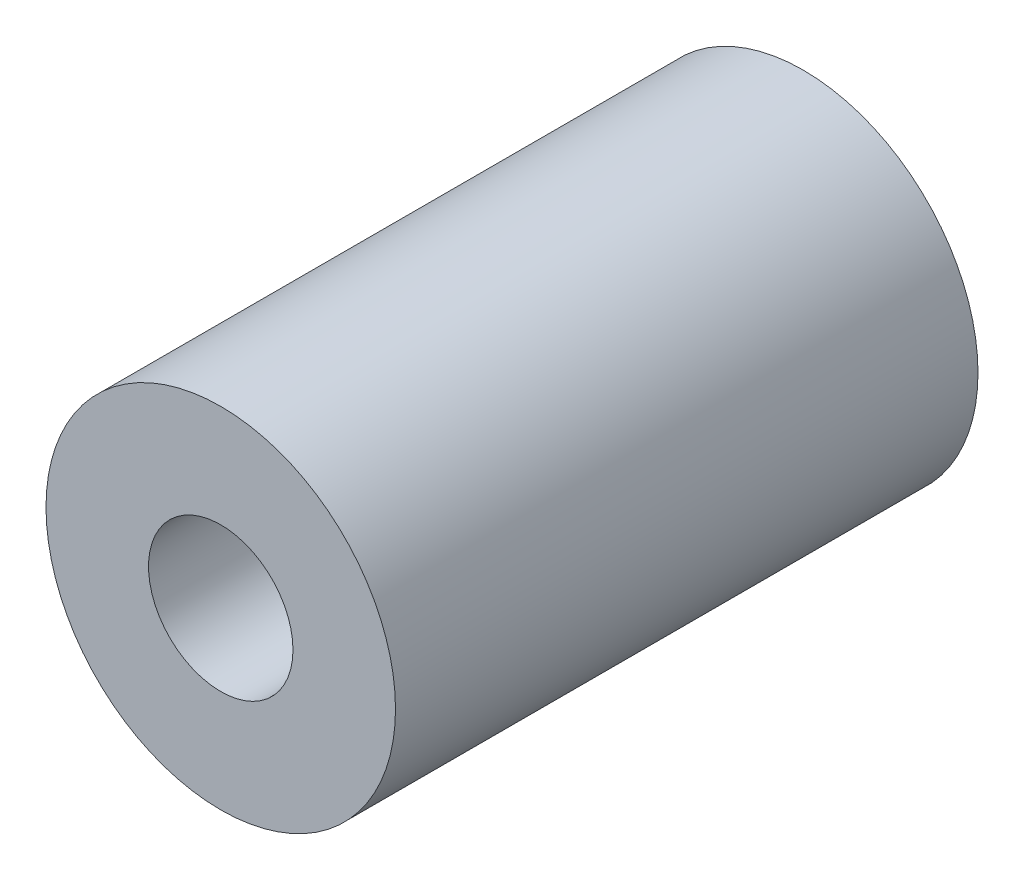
ISO-10303-21;
HEADER;
FILE_DESCRIPTION(('STEP AP214'),'2;1');
FILE_NAME('part.step','',(''),(''),'','','');
FILE_SCHEMA(('AUTOMOTIVE_DESIGN { 1 0 10303 214 1 1 1 1 }'));
ENDSEC;
DATA;
#1=APPLICATION_CONTEXT('core data for automotive mechanical design processes');
#2=APPLICATION_PROTOCOL_DEFINITION('international standard','automotive_design',2000,#1);
#3=PRODUCT_CONTEXT('',#1,'mechanical');
#4=PRODUCT('Part','Part','',(#3));
#5=PRODUCT_RELATED_PRODUCT_CATEGORY('part','',(#4));
#6=PRODUCT_DEFINITION_FORMATION('','',#4);
#7=PRODUCT_DEFINITION_CONTEXT('part definition',#1,'design');
#8=PRODUCT_DEFINITION('design','',#6,#7);
#9=PRODUCT_DEFINITION_SHAPE('','',#8);
#10=(LENGTH_UNIT() NAMED_UNIT(*) SI_UNIT(.MILLI.,.METRE.));
#11=(NAMED_UNIT(*) PLANE_ANGLE_UNIT() SI_UNIT($,.RADIAN.));
#12=(NAMED_UNIT(*) SI_UNIT($,.STERADIAN.) SOLID_ANGLE_UNIT());
#13=UNCERTAINTY_MEASURE_WITH_UNIT(LENGTH_MEASURE(1.E-05),#10,'distance_accuracy_value','');
#14=(GEOMETRIC_REPRESENTATION_CONTEXT(3) GLOBAL_UNCERTAINTY_ASSIGNED_CONTEXT((#13)) GLOBAL_UNIT_ASSIGNED_CONTEXT((#10,
#11,#12)) REPRESENTATION_CONTEXT('',''));
#15=CARTESIAN_POINT('',(0.,0.,0.));
#16=DIRECTION('',(0.,0.,1.));
#17=DIRECTION('',(1.,0.,0.));
#18=AXIS2_PLACEMENT_3D('',#15,#16,#17);
#19=CARTESIAN_POINT('',(0.,0.,25.));
#20=DIRECTION('',(0.,0.,-1.));
#21=DIRECTION('',(-1.,0.,0.));
#22=AXIS2_PLACEMENT_3D('',#19,#20,#21);
#23=CYLINDRICAL_SURFACE('',#22,7.5);
#24=CARTESIAN_POINT('',(0.,0.,25.));
#25=DIRECTION('',(0.,0.,1.));
#26=DIRECTION('',(1.,0.,0.));
#27=AXIS2_PLACEMENT_3D('',#24,#25,#26);
#28=CIRCLE('',#27,7.5);
#29=CARTESIAN_POINT('',(7.5,0.,25.));
#30=VERTEX_POINT('',#29);
#31=EDGE_CURVE('E10',#30,#30,#28,.T.);
#32=ORIENTED_EDGE('',*,*,#31,.F.);
#33=EDGE_LOOP('',(#32));
#34=FACE_BOUND('',#33,.T.);
#35=CARTESIAN_POINT('',(0.,0.,0.));
#36=DIRECTION('',(0.,0.,1.));
#37=DIRECTION('',(1.,0.,0.));
#38=AXIS2_PLACEMENT_3D('',#35,#36,#37);
#39=CIRCLE('',#38,7.5);
#40=CARTESIAN_POINT('',(7.5,0.,0.));
#41=VERTEX_POINT('',#40);
#42=EDGE_CURVE('E33',#41,#41,#39,.T.);
#43=ORIENTED_EDGE('',*,*,#42,.T.);
#44=EDGE_LOOP('',(#43));
#45=FACE_BOUND('',#44,.T.);
#46=ADVANCED_FACE('F30',(#34,#45),#23,.T.);
#47=CARTESIAN_POINT('',(0.,0.,25.));
#48=DIRECTION('',(0.,0.,1.));
#49=DIRECTION('',(1.,0.,0.));
#50=AXIS2_PLACEMENT_3D('',#47,#48,#49);
#51=PLANE('',#50);
#52=CARTESIAN_POINT('',(0.,0.,25.));
#53=DIRECTION('',(0.,0.,1.));
#54=DIRECTION('',(1.,0.,0.));
#55=AXIS2_PLACEMENT_3D('',#52,#53,#54);
#56=CIRCLE('',#55,3.1);
#57=CARTESIAN_POINT('',(3.1,0.,25.));
#58=VERTEX_POINT('',#57);
#59=EDGE_CURVE('E42',#58,#58,#56,.T.);
#60=ORIENTED_EDGE('',*,*,#59,.F.);
#61=EDGE_LOOP('',(#60));
#62=FACE_BOUND('',#61,.T.);
#63=ORIENTED_EDGE('',*,*,#31,.T.);
#64=EDGE_LOOP('',(#63));
#65=FACE_BOUND('',#64,.T.);
#66=ADVANCED_FACE('F57',(#62,#65),#51,.T.);
#67=CARTESIAN_POINT('',(0.,0.,0.));
#68=DIRECTION('',(0.,0.,1.));
#69=DIRECTION('',(1.,0.,0.));
#70=AXIS2_PLACEMENT_3D('',#67,#68,#69);
#71=PLANE('',#70);
#72=CARTESIAN_POINT('',(0.,0.,0.));
#73=DIRECTION('',(0.,0.,1.));
#74=DIRECTION('',(1.,0.,0.));
#75=AXIS2_PLACEMENT_3D('',#72,#73,#74);
#76=CIRCLE('',#75,3.1);
#77=CARTESIAN_POINT('',(3.1,0.,0.));
#78=VERTEX_POINT('',#77);
#79=EDGE_CURVE('E40',#78,#78,#76,.T.);
#80=ORIENTED_EDGE('',*,*,#79,.T.);
#81=EDGE_LOOP('',(#80));
#82=FACE_BOUND('',#81,.T.);
#83=ORIENTED_EDGE('',*,*,#42,.F.);
#84=EDGE_LOOP('',(#83));
#85=FACE_BOUND('',#84,.T.);
#86=ADVANCED_FACE('F48',(#82,#85),#71,.F.);
#87=CARTESIAN_POINT('',(0.,0.,0.));
#88=DIRECTION('',(0.,0.,1.));
#89=DIRECTION('',(1.,0.,0.));
#90=AXIS2_PLACEMENT_3D('',#87,#88,#89);
#91=CYLINDRICAL_SURFACE('',#90,3.1);
#92=ORIENTED_EDGE('',*,*,#79,.F.);
#93=EDGE_LOOP('',(#92));
#94=FACE_BOUND('',#93,.T.);
#95=ORIENTED_EDGE('',*,*,#59,.T.);
#96=EDGE_LOOP('',(#95));
#97=FACE_BOUND('',#96,.T.);
#98=ADVANCED_FACE('F51',(#94,#97),#91,.F.);
#99=CLOSED_SHELL('',(#46,#66,#86,#98));
#100=MANIFOLD_SOLID_BREP('B2',#99);
#101=ADVANCED_BREP_SHAPE_REPRESENTATION('',(#18,#100),#14);
#102=SHAPE_DEFINITION_REPRESENTATION(#9,#101);
ENDSEC;
END-ISO-10303-21;
